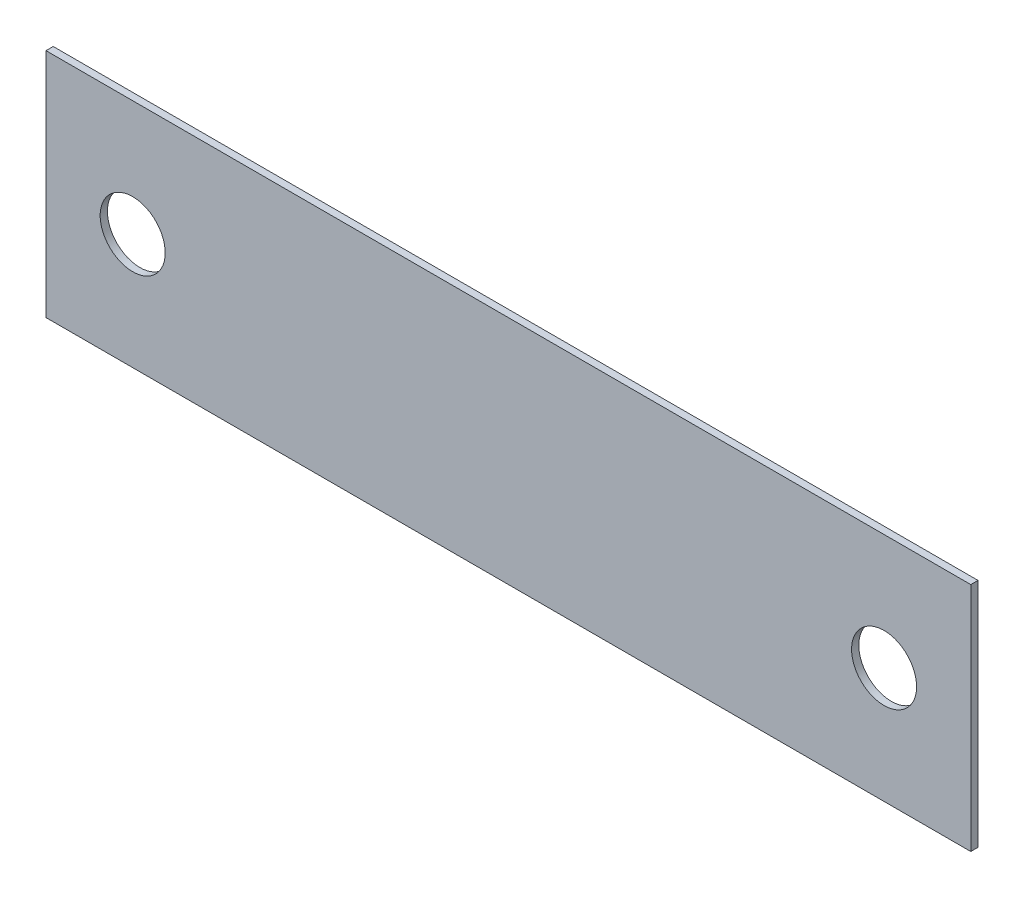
from build123d import *

# Parameters (mm, degrees)
SKETCH1_W           = 50.8
SKETCH1_H           = 203.2
BOSS_EXTRUDE1_DEPTH = 1.5875
SKETCH2_R           = 7.14375
CUT_EXTRUDE1_DEPTH  = 1.5875


with BuildPart() as part:
    # Sketch1 → Boss-Extrude1 (new body)
    with BuildSketch(Plane(origin=(0, 0, 0), x_dir=(0, 1, 0), z_dir=(0, 0, 1))):
        Rectangle(SKETCH1_W, SKETCH1_H)
    extrude(amount=BOSS_EXTRUDE1_DEPTH)

    # Sketch2 → Cut-Extrude1 (cut)
    with BuildSketch(Plane(origin=(0, 0, 0), x_dir=(-1, 0, 0), z_dir=(0, 0, 1))):
        with Locations(Location((-82.55, 0, 0), (0, 0, 180))):
            Circle(SKETCH2_R)
        with Locations(Location((82.55, 0, 0), (0, 0, 180))):
            Circle(SKETCH2_R)
    extrude(amount=CUT_EXTRUDE1_DEPTH, mode=Mode.SUBTRACT)


solid = part.part
